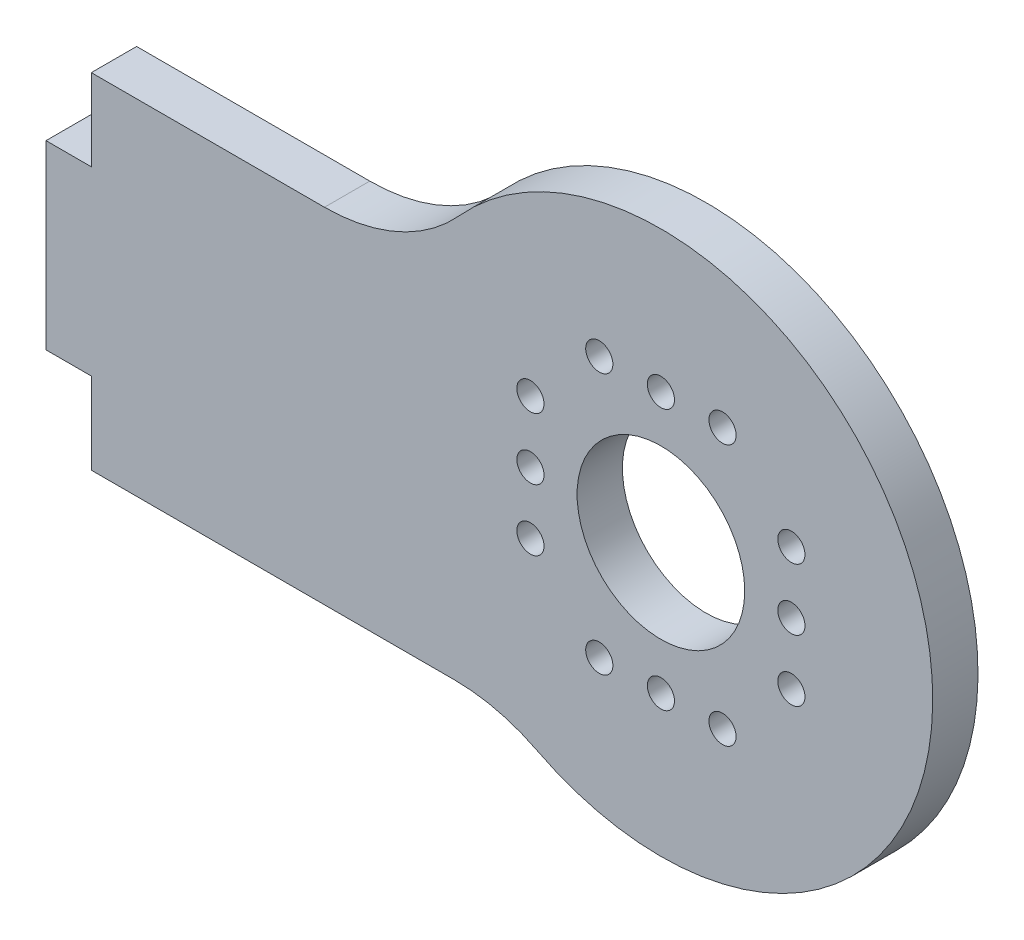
ISO-10303-21;
HEADER;
FILE_DESCRIPTION(('STEP AP214'),'2;1');
FILE_NAME('part.step','',(''),(''),'','','');
FILE_SCHEMA(('AUTOMOTIVE_DESIGN { 1 0 10303 214 1 1 1 1 }'));
ENDSEC;
DATA;
#1=APPLICATION_CONTEXT('core data for automotive mechanical design processes');
#2=APPLICATION_PROTOCOL_DEFINITION('international standard','automotive_design',2000,#1);
#3=PRODUCT_CONTEXT('',#1,'mechanical');
#4=PRODUCT('Part','Part','',(#3));
#5=PRODUCT_RELATED_PRODUCT_CATEGORY('part','',(#4));
#6=PRODUCT_DEFINITION_FORMATION('','',#4);
#7=PRODUCT_DEFINITION_CONTEXT('part definition',#1,'design');
#8=PRODUCT_DEFINITION('design','',#6,#7);
#9=PRODUCT_DEFINITION_SHAPE('','',#8);
#10=(LENGTH_UNIT() NAMED_UNIT(*) SI_UNIT(.MILLI.,.METRE.));
#11=(NAMED_UNIT(*) PLANE_ANGLE_UNIT() SI_UNIT($,.RADIAN.));
#12=(NAMED_UNIT(*) SI_UNIT($,.STERADIAN.) SOLID_ANGLE_UNIT());
#13=UNCERTAINTY_MEASURE_WITH_UNIT(LENGTH_MEASURE(1.E-05),#10,'distance_accuracy_value','');
#14=(GEOMETRIC_REPRESENTATION_CONTEXT(3) GLOBAL_UNCERTAINTY_ASSIGNED_CONTEXT((#13)) GLOBAL_UNIT_ASSIGNED_CONTEXT((#10,
#11,#12)) REPRESENTATION_CONTEXT('',''));
#15=CARTESIAN_POINT('',(0.,0.,0.));
#16=DIRECTION('',(0.,0.,1.));
#17=DIRECTION('',(1.,0.,0.));
#18=AXIS2_PLACEMENT_3D('',#15,#16,#17);
#19=CARTESIAN_POINT('',(-18.5639523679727,16.7445415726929,2.5));
#20=DIRECTION('',(0.,0.,1.));
#21=DIRECTION('',(1.,0.,0.));
#22=AXIS2_PLACEMENT_3D('',#19,#20,#21);
#23=PLANE('',#22);
#24=CARTESIAN_POINT('',(7.20000000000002,-3.39999999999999,2.5));
#25=DIRECTION('',(0.,0.,1.));
#26=DIRECTION('',(1.,0.,0.));
#27=AXIS2_PLACEMENT_3D('',#24,#25,#26);
#28=CIRCLE('',#27,0.75);
#29=CARTESIAN_POINT('',(7.95000000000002,-3.39999999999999,2.5));
#30=VERTEX_POINT('',#29);
#31=EDGE_CURVE('E335',#30,#30,#28,.T.);
#32=ORIENTED_EDGE('',*,*,#31,.F.);
#33=EDGE_LOOP('',(#32));
#34=FACE_BOUND('',#33,.T.);
#35=CARTESIAN_POINT('',(3.40000000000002,7.20000000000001,2.5));
#36=DIRECTION('',(0.,0.,1.));
#37=DIRECTION('',(1.,0.,0.));
#38=AXIS2_PLACEMENT_3D('',#35,#36,#37);
#39=CIRCLE('',#38,0.75);
#40=CARTESIAN_POINT('',(4.15000000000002,7.20000000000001,2.5));
#41=VERTEX_POINT('',#40);
#42=EDGE_CURVE('E319',#41,#41,#39,.T.);
#43=ORIENTED_EDGE('',*,*,#42,.F.);
#44=EDGE_LOOP('',(#43));
#45=FACE_BOUND('',#44,.T.);
#46=CARTESIAN_POINT('',(-7.19999999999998,3.40000000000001,2.5));
#47=DIRECTION('',(0.,0.,1.));
#48=DIRECTION('',(1.,0.,0.));
#49=AXIS2_PLACEMENT_3D('',#46,#47,#48);
#50=CIRCLE('',#49,0.75);
#51=CARTESIAN_POINT('',(-6.44999999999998,3.40000000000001,2.5));
#52=VERTEX_POINT('',#51);
#53=EDGE_CURVE('E303',#52,#52,#50,.T.);
#54=ORIENTED_EDGE('',*,*,#53,.F.);
#55=EDGE_LOOP('',(#54));
#56=FACE_BOUND('',#55,.T.);
#57=CARTESIAN_POINT('',(-3.39999999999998,-7.19999999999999,2.5));
#58=DIRECTION('',(0.,0.,1.));
#59=DIRECTION('',(1.,0.,0.));
#60=AXIS2_PLACEMENT_3D('',#57,#58,#59);
#61=CIRCLE('',#60,0.750000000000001);
#62=CARTESIAN_POINT('',(-2.64999999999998,-7.19999999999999,2.5));
#63=VERTEX_POINT('',#62);
#64=EDGE_CURVE('E287',#63,#63,#61,.T.);
#65=ORIENTED_EDGE('',*,*,#64,.F.);
#66=EDGE_LOOP('',(#65));
#67=FACE_BOUND('',#66,.T.);
#68=CARTESIAN_POINT('',(0.,7.20000000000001,2.5));
#69=DIRECTION('',(0.,0.,1.));
#70=DIRECTION('',(1.,0.,0.));
#71=AXIS2_PLACEMENT_3D('',#68,#69,#70);
#72=CIRCLE('',#71,0.75);
#73=CARTESIAN_POINT('',(0.750000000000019,7.20000000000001,2.5));
#74=VERTEX_POINT('',#73);
#75=EDGE_CURVE('E271',#74,#74,#72,.T.);
#76=ORIENTED_EDGE('',*,*,#75,.F.);
#77=EDGE_LOOP('',(#76));
#78=FACE_BOUND('',#77,.T.);
#79=CARTESIAN_POINT('',(-7.19999999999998,0.,2.5));
#80=DIRECTION('',(0.,0.,1.));
#81=DIRECTION('',(1.,0.,0.));
#82=AXIS2_PLACEMENT_3D('',#79,#80,#81);
#83=CIRCLE('',#82,0.75);
#84=CARTESIAN_POINT('',(-6.44999999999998,0.,2.5));
#85=VERTEX_POINT('',#84);
#86=EDGE_CURVE('E255',#85,#85,#83,.T.);
#87=ORIENTED_EDGE('',*,*,#86,.F.);
#88=EDGE_LOOP('',(#87));
#89=FACE_BOUND('',#88,.T.);
#90=CARTESIAN_POINT('',(-18.5639523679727,16.7445415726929,2.5));
#91=DIRECTION('',(0.,0.,-1.));
#92=DIRECTION('',(1.,0.,0.));
#93=AXIS2_PLACEMENT_3D('',#90,#91,#92);
#94=CIRCLE('',#93,10.);
#95=CARTESIAN_POINT('',(-11.1383714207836,10.0467249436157,2.5));
#96=VERTEX_POINT('',#95);
#97=CARTESIAN_POINT('',(-18.5639523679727,6.74454157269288,2.5));
#98=VERTEX_POINT('',#97);
#99=EDGE_CURVE('E188',#96,#98,#94,.T.);
#100=ORIENTED_EDGE('',*,*,#99,.T.);
#101=DIRECTION('',(-1.,0.,0.));
#102=VECTOR('',#101,1.);
#103=CARTESIAN_POINT('',(-18.5639523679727,6.74454157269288,2.5));
#104=LINE('',#103,#102);
#105=CARTESIAN_POINT('',(-31.431783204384,6.74454157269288,2.5));
#106=VERTEX_POINT('',#105);
#107=EDGE_CURVE('E112',#98,#106,#104,.T.);
#108=ORIENTED_EDGE('',*,*,#107,.T.);
#109=DIRECTION('',(0.,-1.,0.));
#110=VECTOR('',#109,1.);
#111=CARTESIAN_POINT('',(-31.431783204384,6.74454157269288,2.5));
#112=LINE('',#111,#110);
#113=CARTESIAN_POINT('',(-31.431783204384,2.24454157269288,2.5));
#114=VERTEX_POINT('',#113);
#115=EDGE_CURVE('E217',#106,#114,#112,.T.);
#116=ORIENTED_EDGE('',*,*,#115,.T.);
#117=DIRECTION('',(-1.,0.,0.));
#118=VECTOR('',#117,1.);
#119=CARTESIAN_POINT('',(-31.431783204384,2.24454157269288,2.5));
#120=LINE('',#119,#118);
#121=CARTESIAN_POINT('',(-33.931783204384,2.24454157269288,2.5));
#122=VERTEX_POINT('',#121);
#123=EDGE_CURVE('E237',#114,#122,#120,.T.);
#124=ORIENTED_EDGE('',*,*,#123,.T.);
#125=DIRECTION('',(0.,-1.,0.));
#126=VECTOR('',#125,1.);
#127=CARTESIAN_POINT('',(-33.931783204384,2.24454157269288,2.5));
#128=LINE('',#127,#126);
#129=CARTESIAN_POINT('',(-33.931783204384,-7.75545842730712,2.5));
#130=VERTEX_POINT('',#129);
#131=EDGE_CURVE('E233',#122,#130,#128,.T.);
#132=ORIENTED_EDGE('',*,*,#131,.T.);
#133=DIRECTION('',(1.,0.,0.));
#134=VECTOR('',#133,1.);
#135=CARTESIAN_POINT('',(-31.431783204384,-7.75545842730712,2.5));
#136=LINE('',#135,#134);
#137=CARTESIAN_POINT('',(-31.431783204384,-7.75545842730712,2.5));
#138=VERTEX_POINT('',#137);
#139=EDGE_CURVE('E236',#130,#138,#136,.T.);
#140=ORIENTED_EDGE('',*,*,#139,.T.);
#141=DIRECTION('',(0.,-1.,0.));
#142=VECTOR('',#141,1.);
#143=CARTESIAN_POINT('',(-31.431783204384,-7.75545842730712,2.5));
#144=LINE('',#143,#142);
#145=CARTESIAN_POINT('',(-31.431783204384,-12.2554584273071,2.5));
#146=VERTEX_POINT('',#145);
#147=EDGE_CURVE('E137',#138,#146,#144,.T.);
#148=ORIENTED_EDGE('',*,*,#147,.T.);
#149=DIRECTION('',(1.,0.,0.));
#150=VECTOR('',#149,1.);
#151=CARTESIAN_POINT('',(-11.3883523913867,-12.2554584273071,2.5));
#152=LINE('',#151,#150);
#153=CARTESIAN_POINT('',(-11.3883523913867,-12.2554584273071,2.5));
#154=VERTEX_POINT('',#153);
#155=EDGE_CURVE('E131',#146,#154,#152,.T.);
#156=ORIENTED_EDGE('',*,*,#155,.T.);
#157=CARTESIAN_POINT('',(-11.3883523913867,-22.2554584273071,2.5));
#158=DIRECTION('',(0.,0.,-1.));
#159=DIRECTION('',(1.,0.,0.));
#160=AXIS2_PLACEMENT_3D('',#157,#158,#159);
#161=CIRCLE('',#160,10.);
#162=CARTESIAN_POINT('',(-6.83301143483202,-13.3532750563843,2.5));
#163=VERTEX_POINT('',#162);
#164=EDGE_CURVE('E135',#154,#163,#161,.T.);
#165=ORIENTED_EDGE('',*,*,#164,.T.);
#166=CARTESIAN_POINT('',(0.,0.,2.5));
#167=DIRECTION('',(0.,0.,1.));
#168=DIRECTION('',(1.,0.,0.));
#169=AXIS2_PLACEMENT_3D('',#166,#167,#168);
#170=CIRCLE('',#169,15.);
#171=EDGE_CURVE('E63',#163,#96,#170,.T.);
#172=ORIENTED_EDGE('',*,*,#171,.T.);
#173=EDGE_LOOP('',(#100,#108,#116,#124,#132,#140,#148,#156,#165,#172));
#174=FACE_BOUND('',#173,.T.);
#175=CARTESIAN_POINT('',(0.,-7.19999999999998,2.5));
#176=DIRECTION('',(0.,0.,1.));
#177=DIRECTION('',(1.,0.,0.));
#178=AXIS2_PLACEMENT_3D('',#175,#176,#177);
#179=CIRCLE('',#178,0.75);
#180=CARTESIAN_POINT('',(0.750000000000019,-7.19999999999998,2.5));
#181=VERTEX_POINT('',#180);
#182=EDGE_CURVE('E164',#181,#181,#179,.T.);
#183=ORIENTED_EDGE('',*,*,#182,.F.);
#184=EDGE_LOOP('',(#183));
#185=FACE_BOUND('',#184,.T.);
#186=CARTESIAN_POINT('',(7.20000000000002,0.,2.5));
#187=DIRECTION('',(0.,0.,1.));
#188=DIRECTION('',(1.,0.,0.));
#189=AXIS2_PLACEMENT_3D('',#186,#187,#188);
#190=CIRCLE('',#189,0.75);
#191=CARTESIAN_POINT('',(7.95000000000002,0.,2.5));
#192=VERTEX_POINT('',#191);
#193=EDGE_CURVE('E263',#192,#192,#190,.T.);
#194=ORIENTED_EDGE('',*,*,#193,.F.);
#195=EDGE_LOOP('',(#194));
#196=FACE_BOUND('',#195,.T.);
#197=CARTESIAN_POINT('',(3.40000000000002,-7.19999999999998,2.5));
#198=DIRECTION('',(0.,0.,1.));
#199=DIRECTION('',(1.,0.,0.));
#200=AXIS2_PLACEMENT_3D('',#197,#198,#199);
#201=CIRCLE('',#200,0.750000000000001);
#202=CARTESIAN_POINT('',(4.15000000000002,-7.19999999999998,2.5));
#203=VERTEX_POINT('',#202);
#204=EDGE_CURVE('E279',#203,#203,#201,.T.);
#205=ORIENTED_EDGE('',*,*,#204,.F.);
#206=EDGE_LOOP('',(#205));
#207=FACE_BOUND('',#206,.T.);
#208=CARTESIAN_POINT('',(-7.19999999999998,-3.39999999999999,2.5));
#209=DIRECTION('',(0.,0.,1.));
#210=DIRECTION('',(1.,0.,0.));
#211=AXIS2_PLACEMENT_3D('',#208,#209,#210);
#212=CIRCLE('',#211,0.75);
#213=CARTESIAN_POINT('',(-6.44999999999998,-3.39999999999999,2.5));
#214=VERTEX_POINT('',#213);
#215=EDGE_CURVE('E295',#214,#214,#212,.T.);
#216=ORIENTED_EDGE('',*,*,#215,.F.);
#217=EDGE_LOOP('',(#216));
#218=FACE_BOUND('',#217,.T.);
#219=CARTESIAN_POINT('',(-3.39999999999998,7.20000000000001,2.5));
#220=DIRECTION('',(0.,0.,1.));
#221=DIRECTION('',(1.,0.,0.));
#222=AXIS2_PLACEMENT_3D('',#219,#220,#221);
#223=CIRCLE('',#222,0.75);
#224=CARTESIAN_POINT('',(-2.64999999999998,7.20000000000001,2.5));
#225=VERTEX_POINT('',#224);
#226=EDGE_CURVE('E311',#225,#225,#223,.T.);
#227=ORIENTED_EDGE('',*,*,#226,.F.);
#228=EDGE_LOOP('',(#227));
#229=FACE_BOUND('',#228,.T.);
#230=CARTESIAN_POINT('',(7.20000000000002,3.40000000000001,2.5));
#231=DIRECTION('',(0.,0.,1.));
#232=DIRECTION('',(1.,0.,0.));
#233=AXIS2_PLACEMENT_3D('',#230,#231,#232);
#234=CIRCLE('',#233,0.75);
#235=CARTESIAN_POINT('',(7.95000000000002,3.40000000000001,2.5));
#236=VERTEX_POINT('',#235);
#237=EDGE_CURVE('E327',#236,#236,#234,.T.);
#238=ORIENTED_EDGE('',*,*,#237,.F.);
#239=EDGE_LOOP('',(#238));
#240=FACE_BOUND('',#239,.T.);
#241=CARTESIAN_POINT('',(0.,0.,2.5));
#242=DIRECTION('',(0.,0.,1.));
#243=DIRECTION('',(1.,0.,0.));
#244=AXIS2_PLACEMENT_3D('',#241,#242,#243);
#245=CIRCLE('',#244,4.625);
#246=CARTESIAN_POINT('',(4.62500000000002,0.,2.5));
#247=VERTEX_POINT('',#246);
#248=EDGE_CURVE('E343',#247,#247,#245,.T.);
#249=ORIENTED_EDGE('',*,*,#248,.F.);
#250=EDGE_LOOP('',(#249));
#251=FACE_BOUND('',#250,.T.);
#252=ADVANCED_FACE('F45',(#34,#45,#56,#67,#78,#89,#174,#185,#196,#207,#218,#229,#240,#251),#23,.T.);
#253=CARTESIAN_POINT('',(-18.5639523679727,16.7445415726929,0.));
#254=DIRECTION('',(0.,0.,1.));
#255=DIRECTION('',(1.,0.,0.));
#256=AXIS2_PLACEMENT_3D('',#253,#254,#255);
#257=PLANE('',#256);
#258=CARTESIAN_POINT('',(-18.5639523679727,16.7445415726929,0.));
#259=DIRECTION('',(0.,0.,-1.));
#260=DIRECTION('',(1.,0.,0.));
#261=AXIS2_PLACEMENT_3D('',#258,#259,#260);
#262=CIRCLE('',#261,10.);
#263=CARTESIAN_POINT('',(-11.1383714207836,10.0467249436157,0.));
#264=VERTEX_POINT('',#263);
#265=CARTESIAN_POINT('',(-18.5639523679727,6.74454157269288,0.));
#266=VERTEX_POINT('',#265);
#267=EDGE_CURVE('E159',#264,#266,#262,.T.);
#268=ORIENTED_EDGE('',*,*,#267,.F.);
#269=CARTESIAN_POINT('',(0.,0.,0.));
#270=DIRECTION('',(0.,0.,1.));
#271=DIRECTION('',(1.,0.,0.));
#272=AXIS2_PLACEMENT_3D('',#269,#270,#271);
#273=CIRCLE('',#272,15.);
#274=CARTESIAN_POINT('',(-6.83301143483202,-13.3532750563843,0.));
#275=VERTEX_POINT('',#274);
#276=EDGE_CURVE('E104',#275,#264,#273,.T.);
#277=ORIENTED_EDGE('',*,*,#276,.F.);
#278=CARTESIAN_POINT('',(-11.3883523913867,-22.2554584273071,0.));
#279=DIRECTION('',(0.,0.,-1.));
#280=DIRECTION('',(1.,0.,0.));
#281=AXIS2_PLACEMENT_3D('',#278,#279,#280);
#282=CIRCLE('',#281,10.);
#283=CARTESIAN_POINT('',(-11.3883523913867,-12.2554584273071,0.));
#284=VERTEX_POINT('',#283);
#285=EDGE_CURVE('E98',#284,#275,#282,.T.);
#286=ORIENTED_EDGE('',*,*,#285,.F.);
#287=DIRECTION('',(1.,0.,0.));
#288=VECTOR('',#287,1.);
#289=CARTESIAN_POINT('',(-11.3883523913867,-12.2554584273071,0.));
#290=LINE('',#289,#288);
#291=CARTESIAN_POINT('',(-31.431783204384,-12.2554584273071,0.));
#292=VERTEX_POINT('',#291);
#293=EDGE_CURVE('E146',#292,#284,#290,.T.);
#294=ORIENTED_EDGE('',*,*,#293,.F.);
#295=DIRECTION('',(0.,-1.,0.));
#296=VECTOR('',#295,1.);
#297=CARTESIAN_POINT('',(-31.431783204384,-7.75545842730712,0.));
#298=LINE('',#297,#296);
#299=CARTESIAN_POINT('',(-31.431783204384,-7.75545842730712,0.));
#300=VERTEX_POINT('',#299);
#301=EDGE_CURVE('E179',#300,#292,#298,.T.);
#302=ORIENTED_EDGE('',*,*,#301,.F.);
#303=DIRECTION('',(1.,0.,0.));
#304=VECTOR('',#303,1.);
#305=CARTESIAN_POINT('',(-31.431783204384,-7.75545842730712,0.));
#306=LINE('',#305,#304);
#307=CARTESIAN_POINT('',(-33.931783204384,-7.75545842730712,0.));
#308=VERTEX_POINT('',#307);
#309=EDGE_CURVE('E176',#308,#300,#306,.T.);
#310=ORIENTED_EDGE('',*,*,#309,.F.);
#311=DIRECTION('',(0.,-1.,0.));
#312=VECTOR('',#311,1.);
#313=CARTESIAN_POINT('',(-33.931783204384,2.24454157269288,0.));
#314=LINE('',#313,#312);
#315=CARTESIAN_POINT('',(-33.931783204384,2.24454157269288,0.));
#316=VERTEX_POINT('',#315);
#317=EDGE_CURVE('E173',#316,#308,#314,.T.);
#318=ORIENTED_EDGE('',*,*,#317,.F.);
#319=DIRECTION('',(-1.,0.,0.));
#320=VECTOR('',#319,1.);
#321=CARTESIAN_POINT('',(-31.431783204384,2.24454157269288,0.));
#322=LINE('',#321,#320);
#323=CARTESIAN_POINT('',(-31.431783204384,2.24454157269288,0.));
#324=VERTEX_POINT('',#323);
#325=EDGE_CURVE('E170',#324,#316,#322,.T.);
#326=ORIENTED_EDGE('',*,*,#325,.F.);
#327=DIRECTION('',(0.,-1.,0.));
#328=VECTOR('',#327,1.);
#329=CARTESIAN_POINT('',(-31.431783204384,6.74454157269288,0.));
#330=LINE('',#329,#328);
#331=CARTESIAN_POINT('',(-31.431783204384,6.74454157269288,0.));
#332=VERTEX_POINT('',#331);
#333=EDGE_CURVE('E167',#332,#324,#330,.T.);
#334=ORIENTED_EDGE('',*,*,#333,.F.);
#335=DIRECTION('',(-1.,0.,0.));
#336=VECTOR('',#335,1.);
#337=CARTESIAN_POINT('',(-18.5639523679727,6.74454157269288,0.));
#338=LINE('',#337,#336);
#339=EDGE_CURVE('E163',#266,#332,#338,.T.);
#340=ORIENTED_EDGE('',*,*,#339,.F.);
#341=EDGE_LOOP('',(#268,#277,#286,#294,#302,#310,#318,#326,#334,#340));
#342=FACE_BOUND('',#341,.T.);
#343=CARTESIAN_POINT('',(0.,-7.19999999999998,0.));
#344=DIRECTION('',(0.,0.,1.));
#345=DIRECTION('',(1.,0.,0.));
#346=AXIS2_PLACEMENT_3D('',#343,#344,#345);
#347=CIRCLE('',#346,0.75);
#348=CARTESIAN_POINT('',(0.750000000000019,-7.19999999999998,0.));
#349=VERTEX_POINT('',#348);
#350=EDGE_CURVE('E251',#349,#349,#347,.T.);
#351=ORIENTED_EDGE('',*,*,#350,.T.);
#352=EDGE_LOOP('',(#351));
#353=FACE_BOUND('',#352,.T.);
#354=CARTESIAN_POINT('',(-7.19999999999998,0.,0.));
#355=DIRECTION('',(0.,0.,1.));
#356=DIRECTION('',(1.,0.,0.));
#357=AXIS2_PLACEMENT_3D('',#354,#355,#356);
#358=CIRCLE('',#357,0.75);
#359=CARTESIAN_POINT('',(-6.44999999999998,0.,0.));
#360=VERTEX_POINT('',#359);
#361=EDGE_CURVE('E259',#360,#360,#358,.T.);
#362=ORIENTED_EDGE('',*,*,#361,.T.);
#363=EDGE_LOOP('',(#362));
#364=FACE_BOUND('',#363,.T.);
#365=CARTESIAN_POINT('',(7.20000000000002,0.,0.));
#366=DIRECTION('',(0.,0.,1.));
#367=DIRECTION('',(1.,0.,0.));
#368=AXIS2_PLACEMENT_3D('',#365,#366,#367);
#369=CIRCLE('',#368,0.75);
#370=CARTESIAN_POINT('',(7.95000000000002,0.,0.));
#371=VERTEX_POINT('',#370);
#372=EDGE_CURVE('E267',#371,#371,#369,.T.);
#373=ORIENTED_EDGE('',*,*,#372,.T.);
#374=EDGE_LOOP('',(#373));
#375=FACE_BOUND('',#374,.T.);
#376=CARTESIAN_POINT('',(0.,7.20000000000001,0.));
#377=DIRECTION('',(0.,0.,1.));
#378=DIRECTION('',(1.,0.,0.));
#379=AXIS2_PLACEMENT_3D('',#376,#377,#378);
#380=CIRCLE('',#379,0.75);
#381=CARTESIAN_POINT('',(0.750000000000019,7.20000000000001,0.));
#382=VERTEX_POINT('',#381);
#383=EDGE_CURVE('E275',#382,#382,#380,.T.);
#384=ORIENTED_EDGE('',*,*,#383,.T.);
#385=EDGE_LOOP('',(#384));
#386=FACE_BOUND('',#385,.T.);
#387=CARTESIAN_POINT('',(3.40000000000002,-7.19999999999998,0.));
#388=DIRECTION('',(0.,0.,1.));
#389=DIRECTION('',(1.,0.,0.));
#390=AXIS2_PLACEMENT_3D('',#387,#388,#389);
#391=CIRCLE('',#390,0.750000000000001);
#392=CARTESIAN_POINT('',(4.15000000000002,-7.19999999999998,0.));
#393=VERTEX_POINT('',#392);
#394=EDGE_CURVE('E283',#393,#393,#391,.T.);
#395=ORIENTED_EDGE('',*,*,#394,.T.);
#396=EDGE_LOOP('',(#395));
#397=FACE_BOUND('',#396,.T.);
#398=CARTESIAN_POINT('',(-3.39999999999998,-7.19999999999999,0.));
#399=DIRECTION('',(0.,0.,1.));
#400=DIRECTION('',(1.,0.,0.));
#401=AXIS2_PLACEMENT_3D('',#398,#399,#400);
#402=CIRCLE('',#401,0.750000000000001);
#403=CARTESIAN_POINT('',(-2.64999999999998,-7.19999999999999,0.));
#404=VERTEX_POINT('',#403);
#405=EDGE_CURVE('E291',#404,#404,#402,.T.);
#406=ORIENTED_EDGE('',*,*,#405,.T.);
#407=EDGE_LOOP('',(#406));
#408=FACE_BOUND('',#407,.T.);
#409=CARTESIAN_POINT('',(-7.19999999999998,-3.39999999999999,0.));
#410=DIRECTION('',(0.,0.,1.));
#411=DIRECTION('',(1.,0.,0.));
#412=AXIS2_PLACEMENT_3D('',#409,#410,#411);
#413=CIRCLE('',#412,0.75);
#414=CARTESIAN_POINT('',(-6.44999999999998,-3.39999999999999,0.));
#415=VERTEX_POINT('',#414);
#416=EDGE_CURVE('E299',#415,#415,#413,.T.);
#417=ORIENTED_EDGE('',*,*,#416,.T.);
#418=EDGE_LOOP('',(#417));
#419=FACE_BOUND('',#418,.T.);
#420=CARTESIAN_POINT('',(-7.19999999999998,3.40000000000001,0.));
#421=DIRECTION('',(0.,0.,1.));
#422=DIRECTION('',(1.,0.,0.));
#423=AXIS2_PLACEMENT_3D('',#420,#421,#422);
#424=CIRCLE('',#423,0.75);
#425=CARTESIAN_POINT('',(-6.44999999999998,3.40000000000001,0.));
#426=VERTEX_POINT('',#425);
#427=EDGE_CURVE('E307',#426,#426,#424,.T.);
#428=ORIENTED_EDGE('',*,*,#427,.T.);
#429=EDGE_LOOP('',(#428));
#430=FACE_BOUND('',#429,.T.);
#431=CARTESIAN_POINT('',(-3.39999999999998,7.20000000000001,0.));
#432=DIRECTION('',(0.,0.,1.));
#433=DIRECTION('',(1.,0.,0.));
#434=AXIS2_PLACEMENT_3D('',#431,#432,#433);
#435=CIRCLE('',#434,0.75);
#436=CARTESIAN_POINT('',(-2.64999999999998,7.20000000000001,0.));
#437=VERTEX_POINT('',#436);
#438=EDGE_CURVE('E315',#437,#437,#435,.T.);
#439=ORIENTED_EDGE('',*,*,#438,.T.);
#440=EDGE_LOOP('',(#439));
#441=FACE_BOUND('',#440,.T.);
#442=CARTESIAN_POINT('',(3.40000000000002,7.20000000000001,0.));
#443=DIRECTION('',(0.,0.,1.));
#444=DIRECTION('',(1.,0.,0.));
#445=AXIS2_PLACEMENT_3D('',#442,#443,#444);
#446=CIRCLE('',#445,0.75);
#447=CARTESIAN_POINT('',(4.15000000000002,7.20000000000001,0.));
#448=VERTEX_POINT('',#447);
#449=EDGE_CURVE('E323',#448,#448,#446,.T.);
#450=ORIENTED_EDGE('',*,*,#449,.T.);
#451=EDGE_LOOP('',(#450));
#452=FACE_BOUND('',#451,.T.);
#453=CARTESIAN_POINT('',(7.20000000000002,3.40000000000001,0.));
#454=DIRECTION('',(0.,0.,1.));
#455=DIRECTION('',(1.,0.,0.));
#456=AXIS2_PLACEMENT_3D('',#453,#454,#455);
#457=CIRCLE('',#456,0.75);
#458=CARTESIAN_POINT('',(7.95000000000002,3.40000000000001,0.));
#459=VERTEX_POINT('',#458);
#460=EDGE_CURVE('E331',#459,#459,#457,.T.);
#461=ORIENTED_EDGE('',*,*,#460,.T.);
#462=EDGE_LOOP('',(#461));
#463=FACE_BOUND('',#462,.T.);
#464=CARTESIAN_POINT('',(7.20000000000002,-3.39999999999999,0.));
#465=DIRECTION('',(0.,0.,1.));
#466=DIRECTION('',(1.,0.,0.));
#467=AXIS2_PLACEMENT_3D('',#464,#465,#466);
#468=CIRCLE('',#467,0.75);
#469=CARTESIAN_POINT('',(7.95000000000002,-3.39999999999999,0.));
#470=VERTEX_POINT('',#469);
#471=EDGE_CURVE('E339',#470,#470,#468,.T.);
#472=ORIENTED_EDGE('',*,*,#471,.T.);
#473=EDGE_LOOP('',(#472));
#474=FACE_BOUND('',#473,.T.);
#475=CARTESIAN_POINT('',(0.,0.,0.));
#476=DIRECTION('',(0.,0.,1.));
#477=DIRECTION('',(1.,0.,0.));
#478=AXIS2_PLACEMENT_3D('',#475,#476,#477);
#479=CIRCLE('',#478,4.625);
#480=CARTESIAN_POINT('',(4.62500000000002,0.,0.));
#481=VERTEX_POINT('',#480);
#482=EDGE_CURVE('E347',#481,#481,#479,.T.);
#483=ORIENTED_EDGE('',*,*,#482,.T.);
#484=EDGE_LOOP('',(#483));
#485=FACE_BOUND('',#484,.T.);
#486=ADVANCED_FACE('F221',(#342,#353,#364,#375,#386,#397,#408,#419,#430,#441,#452,#463,#474,
#485),#257,.F.);
#487=CARTESIAN_POINT('',(-18.5639523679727,16.7445415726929,2.5));
#488=DIRECTION('',(0.,0.,-1.));
#489=DIRECTION('',(-1.,0.,0.));
#490=AXIS2_PLACEMENT_3D('',#487,#488,#489);
#491=CYLINDRICAL_SURFACE('',#490,10.);
#492=ORIENTED_EDGE('',*,*,#267,.T.);
#493=DIRECTION('',(0.,0.,-1.));
#494=VECTOR('',#493,1.);
#495=CARTESIAN_POINT('',(-18.5639523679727,6.74454157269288,2.5));
#496=LINE('',#495,#494);
#497=EDGE_CURVE('E11',#98,#266,#496,.T.);
#498=ORIENTED_EDGE('',*,*,#497,.F.);
#499=ORIENTED_EDGE('',*,*,#99,.F.);
#500=DIRECTION('',(0.,0.,-1.));
#501=VECTOR('',#500,1.);
#502=CARTESIAN_POINT('',(-11.1383714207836,10.0467249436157,2.5));
#503=LINE('',#502,#501);
#504=EDGE_CURVE('E155',#96,#264,#503,.T.);
#505=ORIENTED_EDGE('',*,*,#504,.T.);
#506=EDGE_LOOP('',(#492,#498,#499,#505));
#507=FACE_BOUND('',#506,.T.);
#508=ADVANCED_FACE('F47',(#507),#491,.F.);
#509=CARTESIAN_POINT('',(-18.5639523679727,6.74454157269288,2.5));
#510=DIRECTION('',(0.,-1.,0.));
#511=DIRECTION('',(1.,0.,0.));
#512=AXIS2_PLACEMENT_3D('',#509,#510,#511);
#513=PLANE('',#512);
#514=ORIENTED_EDGE('',*,*,#339,.T.);
#515=DIRECTION('',(0.,0.,-1.));
#516=VECTOR('',#515,1.);
#517=CARTESIAN_POINT('',(-31.431783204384,6.74454157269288,2.5));
#518=LINE('',#517,#516);
#519=EDGE_CURVE('E55',#106,#332,#518,.T.);
#520=ORIENTED_EDGE('',*,*,#519,.F.);
#521=ORIENTED_EDGE('',*,*,#107,.F.);
#522=ORIENTED_EDGE('',*,*,#497,.T.);
#523=EDGE_LOOP('',(#514,#520,#521,#522));
#524=FACE_BOUND('',#523,.T.);
#525=ADVANCED_FACE('F391',(#524),#513,.F.);
#526=CARTESIAN_POINT('',(-31.431783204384,6.74454157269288,2.5));
#527=DIRECTION('',(1.,0.,0.));
#528=DIRECTION('',(0.,0.,-1.));
#529=AXIS2_PLACEMENT_3D('',#526,#527,#528);
#530=PLANE('',#529);
#531=ORIENTED_EDGE('',*,*,#333,.T.);
#532=DIRECTION('',(0.,0.,-1.));
#533=VECTOR('',#532,1.);
#534=CARTESIAN_POINT('',(-31.431783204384,2.24454157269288,2.5));
#535=LINE('',#534,#533);
#536=EDGE_CURVE('E207',#114,#324,#535,.T.);
#537=ORIENTED_EDGE('',*,*,#536,.F.);
#538=ORIENTED_EDGE('',*,*,#115,.F.);
#539=ORIENTED_EDGE('',*,*,#519,.T.);
#540=EDGE_LOOP('',(#531,#537,#538,#539));
#541=FACE_BOUND('',#540,.T.);
#542=ADVANCED_FACE('F215',(#541),#530,.F.);
#543=CARTESIAN_POINT('',(-31.431783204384,2.24454157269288,2.5));
#544=DIRECTION('',(0.,-1.,0.));
#545=DIRECTION('',(0.,0.,-1.));
#546=AXIS2_PLACEMENT_3D('',#543,#544,#545);
#547=PLANE('',#546);
#548=ORIENTED_EDGE('',*,*,#325,.T.);
#549=DIRECTION('',(0.,0.,-1.));
#550=VECTOR('',#549,1.);
#551=CARTESIAN_POINT('',(-33.931783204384,2.24454157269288,2.5));
#552=LINE('',#551,#550);
#553=EDGE_CURVE('E203',#122,#316,#552,.T.);
#554=ORIENTED_EDGE('',*,*,#553,.F.);
#555=ORIENTED_EDGE('',*,*,#123,.F.);
#556=ORIENTED_EDGE('',*,*,#536,.T.);
#557=EDGE_LOOP('',(#548,#554,#555,#556));
#558=FACE_BOUND('',#557,.T.);
#559=ADVANCED_FACE('F227',(#558),#547,.F.);
#560=CARTESIAN_POINT('',(-33.931783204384,2.24454157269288,2.5));
#561=DIRECTION('',(1.,0.,0.));
#562=DIRECTION('',(0.,0.,-1.));
#563=AXIS2_PLACEMENT_3D('',#560,#561,#562);
#564=PLANE('',#563);
#565=ORIENTED_EDGE('',*,*,#317,.T.);
#566=DIRECTION('',(0.,0.,-1.));
#567=VECTOR('',#566,1.);
#568=CARTESIAN_POINT('',(-33.931783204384,-7.75545842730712,2.5));
#569=LINE('',#568,#567);
#570=EDGE_CURVE('E199',#130,#308,#569,.T.);
#571=ORIENTED_EDGE('',*,*,#570,.F.);
#572=ORIENTED_EDGE('',*,*,#131,.F.);
#573=ORIENTED_EDGE('',*,*,#553,.T.);
#574=EDGE_LOOP('',(#565,#571,#572,#573));
#575=FACE_BOUND('',#574,.T.);
#576=ADVANCED_FACE('F231',(#575),#564,.F.);
#577=CARTESIAN_POINT('',(-31.431783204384,-7.75545842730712,2.5));
#578=DIRECTION('',(0.,1.,0.));
#579=DIRECTION('',(-1.,0.,0.));
#580=AXIS2_PLACEMENT_3D('',#577,#578,#579);
#581=PLANE('',#580);
#582=ORIENTED_EDGE('',*,*,#309,.T.);
#583=DIRECTION('',(0.,0.,-1.));
#584=VECTOR('',#583,1.);
#585=CARTESIAN_POINT('',(-31.431783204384,-7.75545842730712,2.5));
#586=LINE('',#585,#584);
#587=EDGE_CURVE('E195',#138,#300,#586,.T.);
#588=ORIENTED_EDGE('',*,*,#587,.F.);
#589=ORIENTED_EDGE('',*,*,#139,.F.);
#590=ORIENTED_EDGE('',*,*,#570,.T.);
#591=EDGE_LOOP('',(#582,#588,#589,#590));
#592=FACE_BOUND('',#591,.T.);
#593=ADVANCED_FACE('F381',(#592),#581,.F.);
#594=CARTESIAN_POINT('',(-31.431783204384,-7.75545842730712,2.5));
#595=DIRECTION('',(1.,0.,0.));
#596=DIRECTION('',(0.,0.,-1.));
#597=AXIS2_PLACEMENT_3D('',#594,#595,#596);
#598=PLANE('',#597);
#599=ORIENTED_EDGE('',*,*,#301,.T.);
#600=DIRECTION('',(0.,0.,-1.));
#601=VECTOR('',#600,1.);
#602=CARTESIAN_POINT('',(-31.431783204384,-12.2554584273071,2.5));
#603=LINE('',#602,#601);
#604=EDGE_CURVE('E148',#146,#292,#603,.T.);
#605=ORIENTED_EDGE('',*,*,#604,.F.);
#606=ORIENTED_EDGE('',*,*,#147,.F.);
#607=ORIENTED_EDGE('',*,*,#587,.T.);
#608=EDGE_LOOP('',(#599,#605,#606,#607));
#609=FACE_BOUND('',#608,.T.);
#610=ADVANCED_FACE('F378',(#609),#598,.F.);
#611=CARTESIAN_POINT('',(-11.3883523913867,-12.2554584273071,2.5));
#612=DIRECTION('',(0.,1.,0.));
#613=DIRECTION('',(-1.,0.,0.));
#614=AXIS2_PLACEMENT_3D('',#611,#612,#613);
#615=PLANE('',#614);
#616=ORIENTED_EDGE('',*,*,#293,.T.);
#617=DIRECTION('',(0.,0.,-1.));
#618=VECTOR('',#617,1.);
#619=CARTESIAN_POINT('',(-11.3883523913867,-12.2554584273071,2.5));
#620=LINE('',#619,#618);
#621=EDGE_CURVE('E143',#154,#284,#620,.T.);
#622=ORIENTED_EDGE('',*,*,#621,.F.);
#623=ORIENTED_EDGE('',*,*,#155,.F.);
#624=ORIENTED_EDGE('',*,*,#604,.T.);
#625=EDGE_LOOP('',(#616,#622,#623,#624));
#626=FACE_BOUND('',#625,.T.);
#627=ADVANCED_FACE('F144',(#626),#615,.F.);
#628=CARTESIAN_POINT('',(-11.3883523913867,-22.2554584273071,2.5));
#629=DIRECTION('',(0.,0.,-1.));
#630=DIRECTION('',(-1.,0.,0.));
#631=AXIS2_PLACEMENT_3D('',#628,#629,#630);
#632=CYLINDRICAL_SURFACE('',#631,10.);
#633=ORIENTED_EDGE('',*,*,#285,.T.);
#634=DIRECTION('',(0.,0.,-1.));
#635=VECTOR('',#634,1.);
#636=CARTESIAN_POINT('',(-6.83301143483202,-13.3532750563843,2.5));
#637=LINE('',#636,#635);
#638=EDGE_CURVE('E149',#163,#275,#637,.T.);
#639=ORIENTED_EDGE('',*,*,#638,.F.);
#640=ORIENTED_EDGE('',*,*,#164,.F.);
#641=ORIENTED_EDGE('',*,*,#621,.T.);
#642=EDGE_LOOP('',(#633,#639,#640,#641));
#643=FACE_BOUND('',#642,.T.);
#644=ADVANCED_FACE('F151',(#643),#632,.F.);
#645=CARTESIAN_POINT('',(0.,0.,2.5));
#646=DIRECTION('',(0.,0.,-1.));
#647=DIRECTION('',(-1.,0.,0.));
#648=AXIS2_PLACEMENT_3D('',#645,#646,#647);
#649=CYLINDRICAL_SURFACE('',#648,15.);
#650=ORIENTED_EDGE('',*,*,#276,.T.);
#651=ORIENTED_EDGE('',*,*,#504,.F.);
#652=ORIENTED_EDGE('',*,*,#171,.F.);
#653=ORIENTED_EDGE('',*,*,#638,.T.);
#654=EDGE_LOOP('',(#650,#651,#652,#653));
#655=FACE_BOUND('',#654,.T.);
#656=ADVANCED_FACE('F371',(#655),#649,.T.);
#657=CARTESIAN_POINT('',(0.,-7.19999999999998,2.5));
#658=DIRECTION('',(0.,0.,-1.));
#659=DIRECTION('',(-1.,0.,0.));
#660=AXIS2_PLACEMENT_3D('',#657,#658,#659);
#661=CYLINDRICAL_SURFACE('',#660,0.75);
#662=ORIENTED_EDGE('',*,*,#182,.T.);
#663=EDGE_LOOP('',(#662));
#664=FACE_BOUND('',#663,.T.);
#665=ORIENTED_EDGE('',*,*,#350,.F.);
#666=EDGE_LOOP('',(#665));
#667=FACE_BOUND('',#666,.T.);
#668=ADVANCED_FACE('F368',(#664,#667),#661,.F.);
#669=CARTESIAN_POINT('',(-7.19999999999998,0.,2.5));
#670=DIRECTION('',(0.,0.,-1.));
#671=DIRECTION('',(-1.,0.,0.));
#672=AXIS2_PLACEMENT_3D('',#669,#670,#671);
#673=CYLINDRICAL_SURFACE('',#672,0.75);
#674=ORIENTED_EDGE('',*,*,#86,.T.);
#675=EDGE_LOOP('',(#674));
#676=FACE_BOUND('',#675,.T.);
#677=ORIENTED_EDGE('',*,*,#361,.F.);
#678=EDGE_LOOP('',(#677));
#679=FACE_BOUND('',#678,.T.);
#680=ADVANCED_FACE('F481',(#676,#679),#673,.F.);
#681=CARTESIAN_POINT('',(7.20000000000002,0.,2.5));
#682=DIRECTION('',(0.,0.,-1.));
#683=DIRECTION('',(-1.,0.,0.));
#684=AXIS2_PLACEMENT_3D('',#681,#682,#683);
#685=CYLINDRICAL_SURFACE('',#684,0.75);
#686=ORIENTED_EDGE('',*,*,#193,.T.);
#687=EDGE_LOOP('',(#686));
#688=FACE_BOUND('',#687,.T.);
#689=ORIENTED_EDGE('',*,*,#372,.F.);
#690=EDGE_LOOP('',(#689));
#691=FACE_BOUND('',#690,.T.);
#692=ADVANCED_FACE('F490',(#688,#691),#685,.F.);
#693=CARTESIAN_POINT('',(0.,7.20000000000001,2.5));
#694=DIRECTION('',(0.,0.,-1.));
#695=DIRECTION('',(-1.,0.,0.));
#696=AXIS2_PLACEMENT_3D('',#693,#694,#695);
#697=CYLINDRICAL_SURFACE('',#696,0.75);
#698=ORIENTED_EDGE('',*,*,#75,.T.);
#699=EDGE_LOOP('',(#698));
#700=FACE_BOUND('',#699,.T.);
#701=ORIENTED_EDGE('',*,*,#383,.F.);
#702=EDGE_LOOP('',(#701));
#703=FACE_BOUND('',#702,.T.);
#704=ADVANCED_FACE('F499',(#700,#703),#697,.F.);
#705=CARTESIAN_POINT('',(3.40000000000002,-7.19999999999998,2.5));
#706=DIRECTION('',(0.,0.,-1.));
#707=DIRECTION('',(-1.,0.,0.));
#708=AXIS2_PLACEMENT_3D('',#705,#706,#707);
#709=CYLINDRICAL_SURFACE('',#708,0.750000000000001);
#710=ORIENTED_EDGE('',*,*,#204,.T.);
#711=EDGE_LOOP('',(#710));
#712=FACE_BOUND('',#711,.T.);
#713=ORIENTED_EDGE('',*,*,#394,.F.);
#714=EDGE_LOOP('',(#713));
#715=FACE_BOUND('',#714,.T.);
#716=ADVANCED_FACE('F509',(#712,#715),#709,.F.);
#717=CARTESIAN_POINT('',(-3.39999999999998,-7.19999999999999,2.5));
#718=DIRECTION('',(0.,0.,-1.));
#719=DIRECTION('',(-1.,0.,0.));
#720=AXIS2_PLACEMENT_3D('',#717,#718,#719);
#721=CYLINDRICAL_SURFACE('',#720,0.750000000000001);
#722=ORIENTED_EDGE('',*,*,#64,.T.);
#723=EDGE_LOOP('',(#722));
#724=FACE_BOUND('',#723,.T.);
#725=ORIENTED_EDGE('',*,*,#405,.F.);
#726=EDGE_LOOP('',(#725));
#727=FACE_BOUND('',#726,.T.);
#728=ADVANCED_FACE('F519',(#724,#727),#721,.F.);
#729=CARTESIAN_POINT('',(-7.19999999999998,-3.39999999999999,2.5));
#730=DIRECTION('',(0.,0.,-1.));
#731=DIRECTION('',(-1.,0.,0.));
#732=AXIS2_PLACEMENT_3D('',#729,#730,#731);
#733=CYLINDRICAL_SURFACE('',#732,0.75);
#734=ORIENTED_EDGE('',*,*,#215,.T.);
#735=EDGE_LOOP('',(#734));
#736=FACE_BOUND('',#735,.T.);
#737=ORIENTED_EDGE('',*,*,#416,.F.);
#738=EDGE_LOOP('',(#737));
#739=FACE_BOUND('',#738,.T.);
#740=ADVANCED_FACE('F529',(#736,#739),#733,.F.);
#741=CARTESIAN_POINT('',(-7.19999999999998,3.40000000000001,2.5));
#742=DIRECTION('',(0.,0.,-1.));
#743=DIRECTION('',(-1.,0.,0.));
#744=AXIS2_PLACEMENT_3D('',#741,#742,#743);
#745=CYLINDRICAL_SURFACE('',#744,0.75);
#746=ORIENTED_EDGE('',*,*,#53,.T.);
#747=EDGE_LOOP('',(#746));
#748=FACE_BOUND('',#747,.T.);
#749=ORIENTED_EDGE('',*,*,#427,.F.);
#750=EDGE_LOOP('',(#749));
#751=FACE_BOUND('',#750,.T.);
#752=ADVANCED_FACE('F539',(#748,#751),#745,.F.);
#753=CARTESIAN_POINT('',(-3.39999999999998,7.20000000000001,2.5));
#754=DIRECTION('',(0.,0.,-1.));
#755=DIRECTION('',(-1.,0.,0.));
#756=AXIS2_PLACEMENT_3D('',#753,#754,#755);
#757=CYLINDRICAL_SURFACE('',#756,0.75);
#758=ORIENTED_EDGE('',*,*,#226,.T.);
#759=EDGE_LOOP('',(#758));
#760=FACE_BOUND('',#759,.T.);
#761=ORIENTED_EDGE('',*,*,#438,.F.);
#762=EDGE_LOOP('',(#761));
#763=FACE_BOUND('',#762,.T.);
#764=ADVANCED_FACE('F549',(#760,#763),#757,.F.);
#765=CARTESIAN_POINT('',(3.40000000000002,7.20000000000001,2.5));
#766=DIRECTION('',(0.,0.,-1.));
#767=DIRECTION('',(-1.,0.,0.));
#768=AXIS2_PLACEMENT_3D('',#765,#766,#767);
#769=CYLINDRICAL_SURFACE('',#768,0.75);
#770=ORIENTED_EDGE('',*,*,#42,.T.);
#771=EDGE_LOOP('',(#770));
#772=FACE_BOUND('',#771,.T.);
#773=ORIENTED_EDGE('',*,*,#449,.F.);
#774=EDGE_LOOP('',(#773));
#775=FACE_BOUND('',#774,.T.);
#776=ADVANCED_FACE('F559',(#772,#775),#769,.F.);
#777=CARTESIAN_POINT('',(7.20000000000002,3.40000000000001,2.5));
#778=DIRECTION('',(0.,0.,-1.));
#779=DIRECTION('',(-1.,0.,0.));
#780=AXIS2_PLACEMENT_3D('',#777,#778,#779);
#781=CYLINDRICAL_SURFACE('',#780,0.75);
#782=ORIENTED_EDGE('',*,*,#237,.T.);
#783=EDGE_LOOP('',(#782));
#784=FACE_BOUND('',#783,.T.);
#785=ORIENTED_EDGE('',*,*,#460,.F.);
#786=EDGE_LOOP('',(#785));
#787=FACE_BOUND('',#786,.T.);
#788=ADVANCED_FACE('F569',(#784,#787),#781,.F.);
#789=CARTESIAN_POINT('',(7.20000000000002,-3.39999999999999,2.5));
#790=DIRECTION('',(0.,0.,-1.));
#791=DIRECTION('',(-1.,0.,0.));
#792=AXIS2_PLACEMENT_3D('',#789,#790,#791);
#793=CYLINDRICAL_SURFACE('',#792,0.75);
#794=ORIENTED_EDGE('',*,*,#31,.T.);
#795=EDGE_LOOP('',(#794));
#796=FACE_BOUND('',#795,.T.);
#797=ORIENTED_EDGE('',*,*,#471,.F.);
#798=EDGE_LOOP('',(#797));
#799=FACE_BOUND('',#798,.T.);
#800=ADVANCED_FACE('F579',(#796,#799),#793,.F.);
#801=CARTESIAN_POINT('',(0.,0.,2.5));
#802=DIRECTION('',(0.,0.,-1.));
#803=DIRECTION('',(-1.,0.,0.));
#804=AXIS2_PLACEMENT_3D('',#801,#802,#803);
#805=CYLINDRICAL_SURFACE('',#804,4.625);
#806=ORIENTED_EDGE('',*,*,#248,.T.);
#807=EDGE_LOOP('',(#806));
#808=FACE_BOUND('',#807,.T.);
#809=ORIENTED_EDGE('',*,*,#482,.F.);
#810=EDGE_LOOP('',(#809));
#811=FACE_BOUND('',#810,.T.);
#812=ADVANCED_FACE('F355',(#808,#811),#805,.F.);
#813=CLOSED_SHELL('',(#252,#486,#508,#525,#542,#559,#576,#593,#610,#627,#644,#656,#668,#680,
#692,#704,#716,#728,#740,#752,#764,#776,#788,#800,#812));
#814=MANIFOLD_SOLID_BREP('B2',#813);
#815=ADVANCED_BREP_SHAPE_REPRESENTATION('',(#18,#814),#14);
#816=SHAPE_DEFINITION_REPRESENTATION(#9,#815);
ENDSEC;
END-ISO-10303-21;
